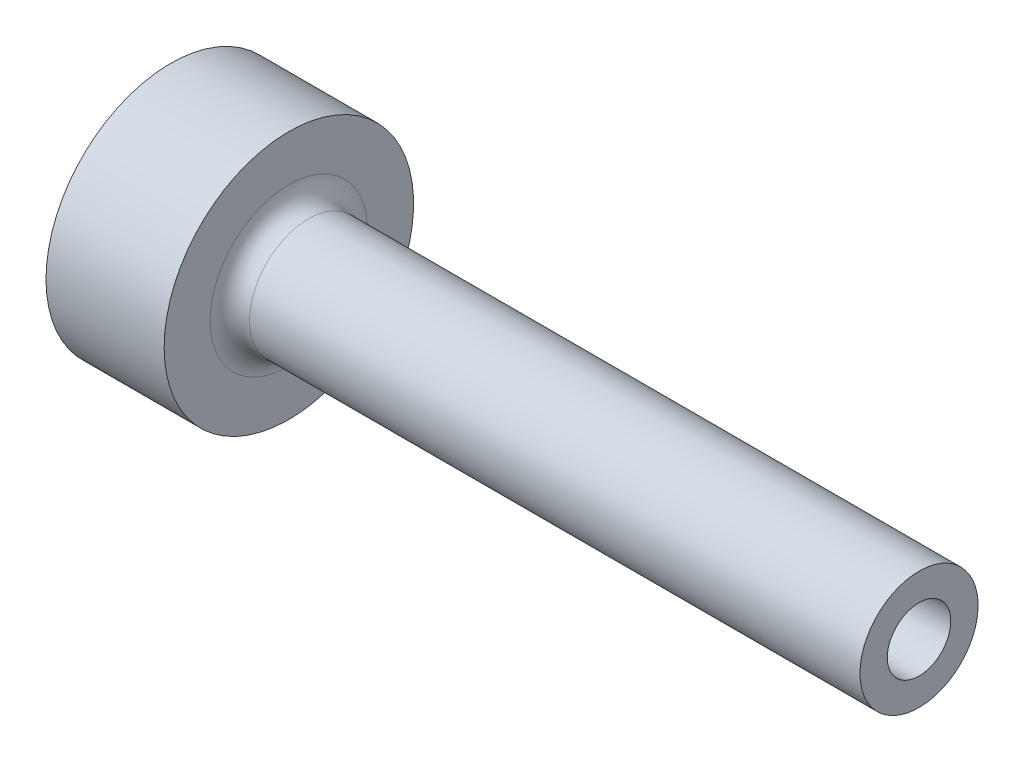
ISO-10303-21;
HEADER;
FILE_DESCRIPTION(('STEP AP214'),'2;1');
FILE_NAME('part.step','',(''),(''),'','','');
FILE_SCHEMA(('AUTOMOTIVE_DESIGN { 1 0 10303 214 1 1 1 1 }'));
ENDSEC;
DATA;
#1=APPLICATION_CONTEXT('core data for automotive mechanical design processes');
#2=APPLICATION_PROTOCOL_DEFINITION('international standard','automotive_design',2000,#1);
#3=PRODUCT_CONTEXT('',#1,'mechanical');
#4=PRODUCT('Part','Part','',(#3));
#5=PRODUCT_RELATED_PRODUCT_CATEGORY('part','',(#4));
#6=PRODUCT_DEFINITION_FORMATION('','',#4);
#7=PRODUCT_DEFINITION_CONTEXT('part definition',#1,'design');
#8=PRODUCT_DEFINITION('design','',#6,#7);
#9=PRODUCT_DEFINITION_SHAPE('','',#8);
#10=(LENGTH_UNIT() NAMED_UNIT(*) SI_UNIT(.MILLI.,.METRE.));
#11=(NAMED_UNIT(*) PLANE_ANGLE_UNIT() SI_UNIT($,.RADIAN.));
#12=(NAMED_UNIT(*) SI_UNIT($,.STERADIAN.) SOLID_ANGLE_UNIT());
#13=UNCERTAINTY_MEASURE_WITH_UNIT(LENGTH_MEASURE(1.E-05),#10,'distance_accuracy_value','');
#14=(GEOMETRIC_REPRESENTATION_CONTEXT(3) GLOBAL_UNCERTAINTY_ASSIGNED_CONTEXT((#13)) GLOBAL_UNIT_ASSIGNED_CONTEXT((#10,
#11,#12)) REPRESENTATION_CONTEXT('',''));
#15=CARTESIAN_POINT('',(0.,0.,0.));
#16=DIRECTION('',(0.,0.,1.));
#17=DIRECTION('',(1.,0.,0.));
#18=AXIS2_PLACEMENT_3D('',#15,#16,#17);
#19=CARTESIAN_POINT('',(0.,0.,0.));
#20=DIRECTION('',(-1.,0.,0.));
#21=DIRECTION('',(0.,0.,1.));
#22=AXIS2_PLACEMENT_3D('',#19,#20,#21);
#23=CYLINDRICAL_SURFACE('',#22,19.);
#24=CARTESIAN_POINT('',(18.,0.,0.));
#25=DIRECTION('',(-1.,0.,0.));
#26=DIRECTION('',(0.,0.,1.));
#27=AXIS2_PLACEMENT_3D('',#24,#25,#26);
#28=CIRCLE('',#27,19.);
#29=CARTESIAN_POINT('',(18.,0.,19.));
#30=VERTEX_POINT('',#29);
#31=EDGE_CURVE('E91',#30,#30,#28,.T.);
#32=ORIENTED_EDGE('',*,*,#31,.T.);
#33=EDGE_LOOP('',(#32));
#34=FACE_BOUND('',#33,.T.);
#35=CARTESIAN_POINT('',(0.,0.,0.));
#36=DIRECTION('',(-1.,0.,0.));
#37=DIRECTION('',(0.,0.,1.));
#38=AXIS2_PLACEMENT_3D('',#35,#36,#37);
#39=CIRCLE('',#38,19.);
#40=CARTESIAN_POINT('',(0.,0.,19.));
#41=VERTEX_POINT('',#40);
#42=EDGE_CURVE('E85',#41,#41,#39,.T.);
#43=ORIENTED_EDGE('',*,*,#42,.F.);
#44=EDGE_LOOP('',(#43));
#45=FACE_BOUND('',#44,.T.);
#46=CARTESIAN_POINT('',(11.,-19.,0.));
#47=CARTESIAN_POINT('',(10.9999951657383,-18.9999986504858,0.11200841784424));
#48=CARTESIAN_POINT('',(10.9905588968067,-18.9989990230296,0.224090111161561));
#49=CARTESIAN_POINT('',(10.953059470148,-18.9951074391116,0.445143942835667));
#50=CARTESIAN_POINT('',(10.9249759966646,-18.9922134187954,0.554112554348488));
#51=CARTESIAN_POINT('',(10.8510107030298,-18.9848596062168,0.765707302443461));
#52=CARTESIAN_POINT('',(10.8051398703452,-18.9804007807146,0.868337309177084));
#53=CARTESIAN_POINT('',(10.696923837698,-18.9704154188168,1.06441973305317));
#54=CARTESIAN_POINT('',(10.6345818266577,-18.9648890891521,1.15787392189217));
#55=CARTESIAN_POINT('',(10.494927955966,-18.9533628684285,1.33334438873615));
#56=CARTESIAN_POINT('',(10.417564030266,-18.9473613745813,1.41531912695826));
#57=CARTESIAN_POINT('',(10.2501736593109,-18.9355744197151,1.565146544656));
#58=CARTESIAN_POINT('',(10.1601466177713,-18.9297889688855,1.63299855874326));
#59=CARTESIAN_POINT('',(9.96972339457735,-18.9190729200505,1.75280323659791));
#60=CARTESIAN_POINT('',(9.86930325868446,-18.914144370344,1.80471802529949));
#61=CARTESIAN_POINT('',(9.66111022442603,-18.9057203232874,1.89093273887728));
#62=CARTESIAN_POINT('',(9.55333752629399,-18.90222478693,1.92523314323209));
#63=CARTESIAN_POINT('',(9.333924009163,-18.8970772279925,1.97512160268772));
#64=CARTESIAN_POINT('',(9.22229908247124,-18.89541839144,1.99077883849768));
#65=CARTESIAN_POINT('',(8.99799439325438,-18.8941109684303,2.0031504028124));
#66=CARTESIAN_POINT('',(8.88531466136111,-18.8944623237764,1.99986527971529));
#67=CARTESIAN_POINT('',(8.66257681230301,-18.8971293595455,1.97450235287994));
#68=CARTESIAN_POINT('',(8.55250997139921,-18.8994371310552,1.9525002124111));
#69=CARTESIAN_POINT('',(8.33763983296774,-18.9057446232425,1.89044560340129));
#70=CARTESIAN_POINT('',(8.23283661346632,-18.9097443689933,1.85039286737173));
#71=CARTESIAN_POINT('',(8.0312304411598,-18.9189942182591,1.75329092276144));
#72=CARTESIAN_POINT('',(7.93444370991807,-18.924246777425,1.69620827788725));
#73=CARTESIAN_POINT('',(7.75179548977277,-18.9354083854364,1.5666908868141));
#74=CARTESIAN_POINT('',(7.66593435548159,-18.9413174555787,1.49425564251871));
#75=CARTESIAN_POINT('',(7.50713503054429,-18.9531615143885,1.33566725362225));
#76=CARTESIAN_POINT('',(7.43426205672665,-18.9590964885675,1.24944878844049));
#77=CARTESIAN_POINT('',(7.30401357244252,-18.9702964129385,1.06596783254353));
#78=CARTESIAN_POINT('',(7.24663808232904,-18.9755613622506,0.968705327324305));
#79=CARTESIAN_POINT('',(7.14901535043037,-18.9848300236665,0.765851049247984));
#80=CARTESIAN_POINT('',(7.10877156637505,-18.9888334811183,0.660257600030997));
#81=CARTESIAN_POINT('',(7.04660317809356,-18.9951255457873,0.443760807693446));
#82=CARTESIAN_POINT('',(7.02467796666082,-18.9974142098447,0.332857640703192));
#83=CARTESIAN_POINT('',(6.9998521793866,-19.0000115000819,0.109454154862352));
#84=CARTESIAN_POINT('',(6.9968616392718,-19.0003294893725,-0.00303606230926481));
#85=CARTESIAN_POINT('',(7.00975357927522,-18.9989747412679,-0.226916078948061));
#86=CARTESIAN_POINT('',(7.02563577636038,-18.9973020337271,-0.338305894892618));
#87=CARTESIAN_POINT('',(7.07574769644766,-18.9921598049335,-0.556562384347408));
#88=CARTESIAN_POINT('',(7.10993514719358,-18.9886944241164,-0.663438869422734));
#89=CARTESIAN_POINT('',(7.1956435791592,-18.9803554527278,-0.869940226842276));
#90=CARTESIAN_POINT('',(7.24716498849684,-18.9754818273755,-0.969564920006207));
#91=CARTESIAN_POINT('',(7.36630089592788,-18.9648478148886,-1.1591405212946));
#92=CARTESIAN_POINT('',(7.43397432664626,-18.9590842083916,-1.2490542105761));
#93=CARTESIAN_POINT('',(7.58340899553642,-18.9473268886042,-1.4162783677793));
#94=CARTESIAN_POINT('',(7.665170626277,-18.9413331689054,-1.49358848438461));
#95=CARTESIAN_POINT('',(7.84085406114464,-18.9297628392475,-1.63372463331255));
#96=CARTESIAN_POINT('',(7.93482318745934,-18.9241879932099,-1.69649150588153));
#97=CARTESIAN_POINT('',(8.13202150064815,-18.9141138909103,-1.80535237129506));
#98=CARTESIAN_POINT('',(8.23525054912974,-18.9096146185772,-1.85144661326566));
#99=CARTESIAN_POINT('',(8.44783784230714,-18.9022123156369,-1.9255553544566));
#100=CARTESIAN_POINT('',(8.55718382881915,-18.8993062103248,-1.95360469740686));
#101=CARTESIAN_POINT('',(8.77906579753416,-18.8954098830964,-1.99094032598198));
#102=CARTESIAN_POINT('',(8.89160167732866,-18.8944195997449,-2.00022721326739));
#103=CARTESIAN_POINT('',(9.11608086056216,-18.8944684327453,-1.99976544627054));
#104=CARTESIAN_POINT('',(9.22802436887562,-18.8954976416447,-1.99010972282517));
#105=CARTESIAN_POINT('',(9.4486892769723,-18.8994483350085,-1.95223204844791));
#106=CARTESIAN_POINT('',(9.55741067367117,-18.9023698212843,-1.92401007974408));
#107=CARTESIAN_POINT('',(9.76854219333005,-18.9097730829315,-1.8498273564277));
#108=CARTESIAN_POINT('',(9.87095340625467,-18.914254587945,-1.80386967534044));
#109=CARTESIAN_POINT('',(10.0666237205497,-18.92427346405,-1.69552954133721));
#110=CARTESIAN_POINT('',(10.1598828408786,-18.9298108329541,-1.63314712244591));
#111=CARTESIAN_POINT('',(10.3350778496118,-18.9413500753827,-1.49337993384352));
#112=CARTESIAN_POINT('',(10.4169583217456,-18.9473540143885,-1.41592586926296));
#113=CARTESIAN_POINT('',(10.5665993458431,-18.9591311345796,-1.24835332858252));
#114=CARTESIAN_POINT('',(10.6343565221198,-18.9649042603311,-1.15823183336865));
#115=CARTESIAN_POINT('',(10.7539774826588,-18.975586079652,-0.967607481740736));
#116=CARTESIAN_POINT('',(10.8057969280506,-18.9804923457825,-0.867076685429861));
#117=CARTESIAN_POINT('',(10.8917493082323,-18.9888617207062,-0.658751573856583));
#118=CARTESIAN_POINT('',(10.9259020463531,-18.9923264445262,-0.550965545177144));
#119=CARTESIAN_POINT('',(10.9671005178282,-18.9965585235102,-0.368815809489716));
#120=CARTESIAN_POINT('',(10.9794208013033,-18.9978430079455,-0.295613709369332));
#121=CARTESIAN_POINT('',(10.9958721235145,-18.9995641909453,-0.148285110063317));
#122=CARTESIAN_POINT('',(11.0000032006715,-19.0000008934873,-0.0741586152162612));
#123=CARTESIAN_POINT('',(11.,-19.,0.));
#124=B_SPLINE_CURVE_WITH_KNOTS('',3,(#46,#47,#48,#49,#50,#51,#52,#53,#54,#55,#56,#57,#58,#59,
#60,#61,#62,#63,#64,#65,#66,#67,#68,#69,#70,#71,#72,#73,#74,#75,#76,#77,#78,#79,#80,#81,#82,#83,
#84,#85,#86,#87,#88,#89,#90,#91,#92,#93,#94,#95,#96,#97,#98,#99,#100,#101,#102,#103,#104,#105,
#106,#107,#108,#109,#110,#111,#112,#113,#114,#115,#116,#117,#118,#119,#120,#121,#122,#123),
.UNSPECIFIED.,.T.,.F.,(4,2,2,2,2,2,2,2,2,2,2,2,2,2,2,2,2,2,2,2,2,2,2,2,2,2,2,2,2,2,2,2,2,2,2,2,
2,2,4),(0.,0.335754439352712,0.671875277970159,1.00778882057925,1.34363737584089,
1.68067146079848,2.01772142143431,2.35556629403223,2.69340196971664,3.02998006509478,
3.36654841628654,3.7017626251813,4.03698180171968,4.37286352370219,4.70875614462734,
5.0462905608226,5.38382542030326,5.72142837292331,6.05902013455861,6.39500668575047,
6.73098819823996,7.06619715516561,7.40141439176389,7.73787392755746,8.07434284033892,
8.41215732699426,8.74996676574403,9.08712193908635,9.42426630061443,9.75976079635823,
10.095255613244,10.4306923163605,10.7661283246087,11.103144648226,11.4402414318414,
11.7782677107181,12.1159142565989,12.3382118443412,12.5605083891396),.UNSPECIFIED.);
#125=CARTESIAN_POINT('',(11.,-19.,0.));
#126=VERTEX_POINT('',#125);
#127=EDGE_CURVE('E10',#126,#126,#124,.T.);
#128=ORIENTED_EDGE('',*,*,#127,.F.);
#129=EDGE_LOOP('',(#128));
#130=FACE_BOUND('',#129,.T.);
#131=ADVANCED_FACE('F16',(#34,#45,#130),#23,.T.);
#132=CARTESIAN_POINT('',(0.,0.,0.));
#133=DIRECTION('',(1.,0.,0.));
#134=DIRECTION('',(0.,0.,-1.));
#135=AXIS2_PLACEMENT_3D('',#132,#133,#134);
#136=CONICAL_SURFACE('',#135,2.25,0.0226892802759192);
#137=CARTESIAN_POINT('',(114.,0.,0.));
#138=DIRECTION('',(-1.,0.,0.));
#139=DIRECTION('',(0.,0.,1.));
#140=AXIS2_PLACEMENT_3D('',#137,#138,#139);
#141=CIRCLE('',#140,4.83702190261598);
#142=CARTESIAN_POINT('',(114.,0.,4.83702190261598));
#143=VERTEX_POINT('',#142);
#144=EDGE_CURVE('E77',#143,#143,#141,.T.);
#145=ORIENTED_EDGE('',*,*,#144,.F.);
#146=EDGE_LOOP('',(#145));
#147=FACE_BOUND('',#146,.T.);
#148=CARTESIAN_POINT('',(3.81173528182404,0.,0.));
#149=DIRECTION('',(-1.,0.,0.));
#150=DIRECTION('',(0.,0.,1.));
#151=AXIS2_PLACEMENT_3D('',#148,#149,#150);
#152=CIRCLE('',#151,2.33650037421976);
#153=CARTESIAN_POINT('',(3.81173528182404,0.,2.33650037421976));
#154=VERTEX_POINT('',#153);
#155=EDGE_CURVE('E97',#154,#154,#152,.F.);
#156=ORIENTED_EDGE('',*,*,#155,.F.);
#157=EDGE_LOOP('',(#156));
#158=FACE_BOUND('',#157,.T.);
#159=ADVANCED_FACE('F44',(#147,#158),#136,.F.);
#160=CARTESIAN_POINT('',(21.,0.,0.));
#161=DIRECTION('',(-1.,0.,0.));
#162=DIRECTION('',(0.,0.,1.));
#163=AXIS2_PLACEMENT_3D('',#160,#161,#162);
#164=TOROIDAL_SURFACE('',#163,12.,3.);
#165=CARTESIAN_POINT('',(18.,0.,0.));
#166=DIRECTION('',(-1.,0.,0.));
#167=DIRECTION('',(0.,0.,1.));
#168=AXIS2_PLACEMENT_3D('',#165,#166,#167);
#169=CIRCLE('',#168,12.);
#170=CARTESIAN_POINT('',(18.,0.,12.));
#171=VERTEX_POINT('',#170);
#172=EDGE_CURVE('E94',#171,#171,#169,.T.);
#173=ORIENTED_EDGE('',*,*,#172,.F.);
#174=EDGE_LOOP('',(#173));
#175=FACE_BOUND('',#174,.T.);
#176=CARTESIAN_POINT('',(21.,0.,0.));
#177=DIRECTION('',(-1.,0.,0.));
#178=DIRECTION('',(0.,0.,1.));
#179=AXIS2_PLACEMENT_3D('',#176,#177,#178);
#180=CIRCLE('',#179,9.);
#181=CARTESIAN_POINT('',(21.,0.,9.));
#182=VERTEX_POINT('',#181);
#183=EDGE_CURVE('E29',#182,#182,#180,.T.);
#184=ORIENTED_EDGE('',*,*,#183,.T.);
#185=EDGE_LOOP('',(#184));
#186=FACE_BOUND('',#185,.T.);
#187=ADVANCED_FACE('F18',(#175,#186),#164,.F.);
#188=CARTESIAN_POINT('',(0.,0.,0.));
#189=DIRECTION('',(-1.,0.,0.));
#190=DIRECTION('',(0.,0.,1.));
#191=AXIS2_PLACEMENT_3D('',#188,#189,#190);
#192=CYLINDRICAL_SURFACE('',#191,9.);
#193=ORIENTED_EDGE('',*,*,#183,.F.);
#194=EDGE_LOOP('',(#193));
#195=FACE_BOUND('',#194,.T.);
#196=CARTESIAN_POINT('',(114.,0.,0.));
#197=DIRECTION('',(-1.,0.,0.));
#198=DIRECTION('',(0.,0.,1.));
#199=AXIS2_PLACEMENT_3D('',#196,#197,#198);
#200=CIRCLE('',#199,9.);
#201=CARTESIAN_POINT('',(114.,0.,9.));
#202=VERTEX_POINT('',#201);
#203=EDGE_CURVE('E75',#202,#202,#200,.T.);
#204=ORIENTED_EDGE('',*,*,#203,.T.);
#205=EDGE_LOOP('',(#204));
#206=FACE_BOUND('',#205,.T.);
#207=ADVANCED_FACE('F63',(#195,#206),#192,.T.);
#208=CARTESIAN_POINT('',(114.,9.,0.));
#209=DIRECTION('',(-1.,0.,0.));
#210=DIRECTION('',(0.,0.,1.));
#211=AXIS2_PLACEMENT_3D('',#208,#209,#210);
#212=PLANE('',#211);
#213=ORIENTED_EDGE('',*,*,#203,.F.);
#214=EDGE_LOOP('',(#213));
#215=FACE_BOUND('',#214,.T.);
#216=ORIENTED_EDGE('',*,*,#144,.T.);
#217=EDGE_LOOP('',(#216));
#218=FACE_BOUND('',#217,.T.);
#219=ADVANCED_FACE('F59',(#215,#218),#212,.F.);
#220=CARTESIAN_POINT('',(0.,2.25,0.));
#221=DIRECTION('',(1.,0.,0.));
#222=DIRECTION('',(0.,0.,-1.));
#223=AXIS2_PLACEMENT_3D('',#220,#221,#222);
#224=PLANE('',#223);
#225=CARTESIAN_POINT('',(0.,0.,0.));
#226=DIRECTION('',(-1.,0.,0.));
#227=DIRECTION('',(0.,0.,1.));
#228=AXIS2_PLACEMENT_3D('',#225,#226,#227);
#229=CIRCLE('',#228,15.5);
#230=CARTESIAN_POINT('',(0.,0.,15.5));
#231=VERTEX_POINT('',#230);
#232=EDGE_CURVE('E100',#231,#231,#229,.T.);
#233=ORIENTED_EDGE('',*,*,#232,.F.);
#234=EDGE_LOOP('',(#233));
#235=FACE_BOUND('',#234,.T.);
#236=ORIENTED_EDGE('',*,*,#42,.T.);
#237=EDGE_LOOP('',(#236));
#238=FACE_BOUND('',#237,.T.);
#239=ADVANCED_FACE('F57',(#235,#238),#224,.F.);
#240=CARTESIAN_POINT('',(18.,19.,0.));
#241=DIRECTION('',(-1.,0.,0.));
#242=DIRECTION('',(0.,0.,1.));
#243=AXIS2_PLACEMENT_3D('',#240,#241,#242);
#244=PLANE('',#243);
#245=ORIENTED_EDGE('',*,*,#31,.F.);
#246=EDGE_LOOP('',(#245));
#247=FACE_BOUND('',#246,.T.);
#248=ORIENTED_EDGE('',*,*,#172,.T.);
#249=EDGE_LOOP('',(#248));
#250=FACE_BOUND('',#249,.T.);
#251=ADVANCED_FACE('F55',(#247,#250),#244,.F.);
#252=CARTESIAN_POINT('',(-35.9477938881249,0.,0.));
#253=DIRECTION('',(-1.,0.,0.));
#254=DIRECTION('',(0.,0.,1.));
#255=AXIS2_PLACEMENT_3D('',#252,#253,#254);
#256=DEGENERATE_TOROIDAL_SURFACE('',#255,2.0429790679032,40.,.F.);
#257=ORIENTED_EDGE('',*,*,#232,.T.);
#258=EDGE_LOOP('',(#257));
#259=FACE_BOUND('',#258,.T.);
#260=ORIENTED_EDGE('',*,*,#155,.T.);
#261=EDGE_LOOP('',(#260));
#262=FACE_BOUND('',#261,.T.);
#263=ADVANCED_FACE('F40',(#259,#262),#256,.T.);
#264=CARTESIAN_POINT('',(9.,-19.,0.));
#265=DIRECTION('',(0.,-1.,0.));
#266=DIRECTION('',(1.,0.,0.));
#267=AXIS2_PLACEMENT_3D('',#264,#265,#266);
#268=CYLINDRICAL_SURFACE('',#267,2.);
#269=CARTESIAN_POINT('',(9.,-13.,0.));
#270=DIRECTION('',(0.,-1.,0.));
#271=DIRECTION('',(1.,0.,0.));
#272=AXIS2_PLACEMENT_3D('',#269,#270,#271);
#273=CIRCLE('',#272,2.);
#274=CARTESIAN_POINT('',(11.,-13.,0.));
#275=VERTEX_POINT('',#274);
#276=EDGE_CURVE('E104',#275,#275,#273,.T.);
#277=ORIENTED_EDGE('',*,*,#276,.F.);
#278=EDGE_LOOP('',(#277));
#279=FACE_BOUND('',#278,.T.);
#280=ORIENTED_EDGE('',*,*,#127,.T.);
#281=EDGE_LOOP('',(#280));
#282=FACE_BOUND('',#281,.T.);
#283=ADVANCED_FACE('F34',(#279,#282),#268,.F.);
#284=CARTESIAN_POINT('',(9.,-11.8452994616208,0.));
#285=DIRECTION('',(0.,-1.,0.));
#286=DIRECTION('',(1.,0.,0.));
#287=AXIS2_PLACEMENT_3D('',#284,#285,#286);
#288=CONICAL_SURFACE('',#287,0.,1.0471975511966);
#289=ORIENTED_EDGE('',*,*,#276,.T.);
#290=EDGE_LOOP('',(#289));
#291=FACE_BOUND('',#290,.T.);
#292=CARTESIAN_POINT('',(9.,-11.8452994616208,0.));
#293=VERTEX_POINT('',#292);
#294=VERTEX_LOOP('',#293);
#295=FACE_BOUND('',#294,.T.);
#296=ADVANCED_FACE('F32',(#291,#295),#288,.F.);
#297=CLOSED_SHELL('',(#131,#159,#187,#207,#219,#239,#251,#263,#283,#296));
#298=MANIFOLD_SOLID_BREP('B1',#297);
#299=ADVANCED_BREP_SHAPE_REPRESENTATION('',(#18,#298),#14);
#300=SHAPE_DEFINITION_REPRESENTATION(#9,#299);
ENDSEC;
END-ISO-10303-21;
